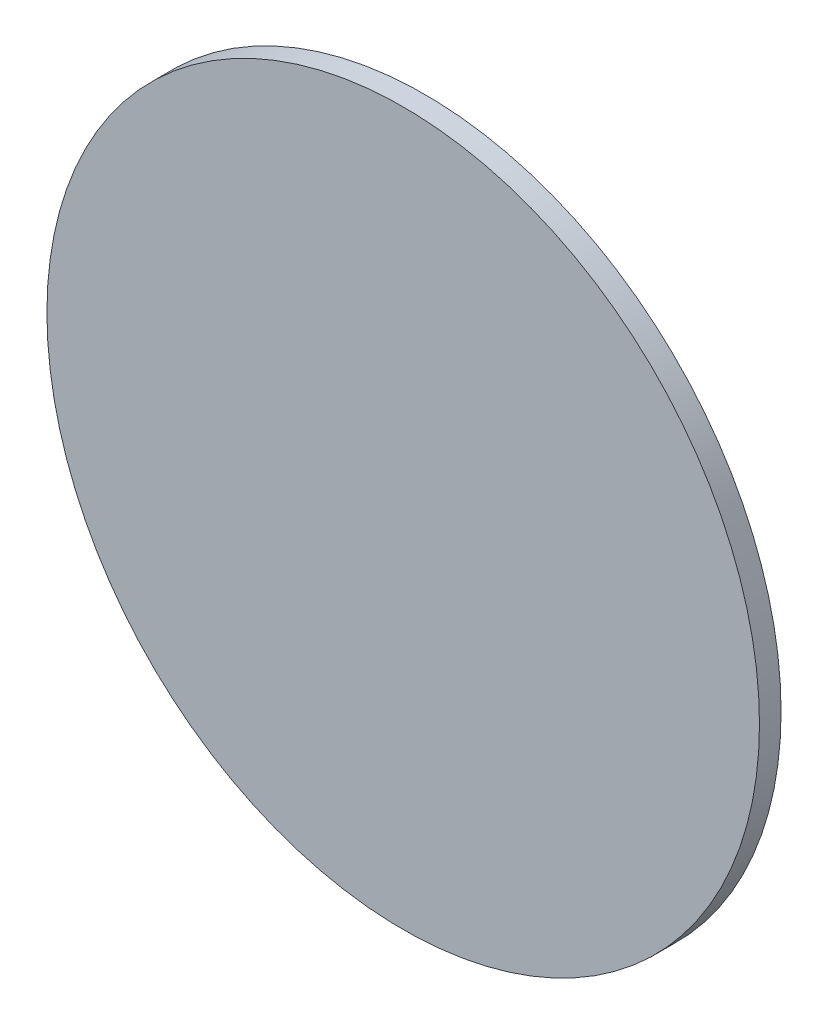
from build123d import *

# Parameters (mm, degrees)
CROQUIS1_R              = 16.5
SALIENTE_EXTRUIR1_DEPTH = 1


with BuildPart() as part:
    # Croquis1 → Saliente-Extruir1 (new body)
    with BuildSketch(Plane.XY):
        Circle(CROQUIS1_R)
    extrude(amount=SALIENTE_EXTRUIR1_DEPTH)


solid = part.part
